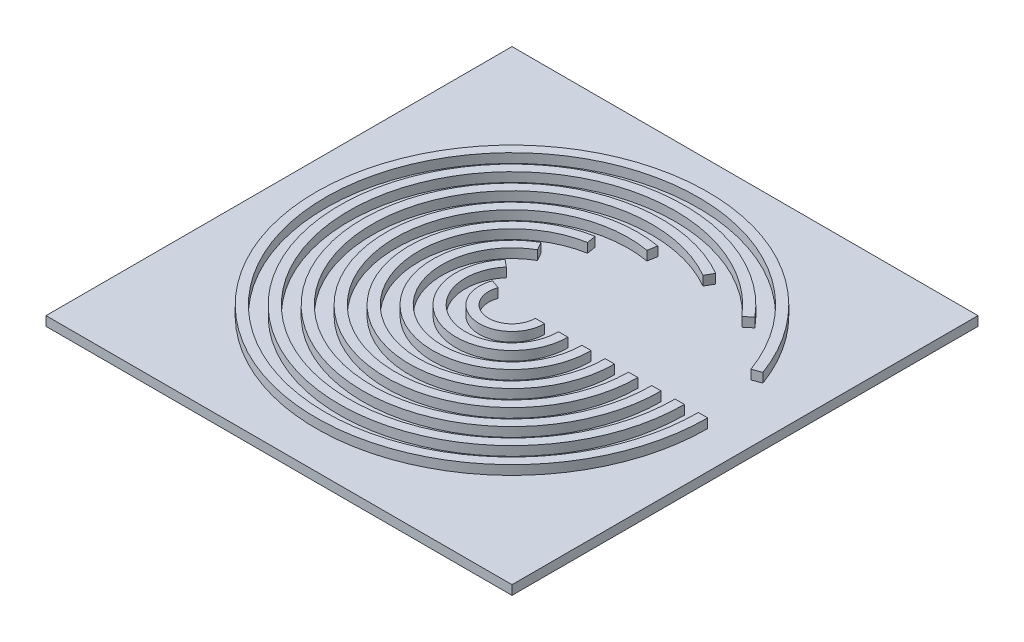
ISO-10303-21;
HEADER;
FILE_DESCRIPTION(('STEP AP214'),'2;1');
FILE_NAME('part.step','',(''),(''),'','','');
FILE_SCHEMA(('AUTOMOTIVE_DESIGN { 1 0 10303 214 1 1 1 1 }'));
ENDSEC;
DATA;
#1=APPLICATION_CONTEXT('core data for automotive mechanical design processes');
#2=APPLICATION_PROTOCOL_DEFINITION('international standard','automotive_design',2000,#1);
#3=PRODUCT_CONTEXT('',#1,'mechanical');
#4=PRODUCT('Part','Part','',(#3));
#5=PRODUCT_RELATED_PRODUCT_CATEGORY('part','',(#4));
#6=PRODUCT_DEFINITION_FORMATION('','',#4);
#7=PRODUCT_DEFINITION_CONTEXT('part definition',#1,'design');
#8=PRODUCT_DEFINITION('design','',#6,#7);
#9=PRODUCT_DEFINITION_SHAPE('','',#8);
#10=(LENGTH_UNIT() NAMED_UNIT(*) SI_UNIT(.MILLI.,.METRE.));
#11=(NAMED_UNIT(*) PLANE_ANGLE_UNIT() SI_UNIT($,.RADIAN.));
#12=(NAMED_UNIT(*) SI_UNIT($,.STERADIAN.) SOLID_ANGLE_UNIT());
#13=UNCERTAINTY_MEASURE_WITH_UNIT(LENGTH_MEASURE(1.E-05),#10,'distance_accuracy_value','');
#14=(GEOMETRIC_REPRESENTATION_CONTEXT(3) GLOBAL_UNCERTAINTY_ASSIGNED_CONTEXT((#13)) GLOBAL_UNIT_ASSIGNED_CONTEXT((#10,
#11,#12)) REPRESENTATION_CONTEXT('',''));
#15=CARTESIAN_POINT('',(0.,0.,0.));
#16=DIRECTION('',(0.,0.,1.));
#17=DIRECTION('',(1.,0.,0.));
#18=AXIS2_PLACEMENT_3D('',#15,#16,#17);
#19=CARTESIAN_POINT('',(0.,10.,0.));
#20=DIRECTION('',(0.,-1.,0.));
#21=DIRECTION('',(0.,0.,-1.));
#22=AXIS2_PLACEMENT_3D('',#19,#20,#21);
#23=PLANE('',#22);
#24=CARTESIAN_POINT('',(250.,10.,-250.));
#25=DIRECTION('',(0.,1.,0.));
#26=DIRECTION('',(1.,0.,0.));
#27=AXIS2_PLACEMENT_3D('',#24,#25,#26);
#28=CIRCLE('',#27,60.);
#29=CARTESIAN_POINT('',(204.037333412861,10.,-288.567256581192));
#30=VERTEX_POINT('',#29);
#31=CARTESIAN_POINT('',(310.,10.,-250.));
#32=VERTEX_POINT('',#31);
#33=EDGE_CURVE('E298',#30,#32,#28,.T.);
#34=ORIENTED_EDGE('',*,*,#33,.F.);
#35=DIRECTION('',(0.766044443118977,0.,0.642787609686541));
#36=VECTOR('',#35,1.);
#37=CARTESIAN_POINT('',(204.037333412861,10.,-288.567256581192));
#38=LINE('',#37,#36);
#39=CARTESIAN_POINT('',(211.697777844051,10.,-282.139380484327));
#40=VERTEX_POINT('',#39);
#41=EDGE_CURVE('E332',#30,#40,#38,.T.);
#42=ORIENTED_EDGE('',*,*,#41,.T.);
#43=CARTESIAN_POINT('',(250.,10.,-250.));
#44=DIRECTION('',(0.,1.,0.));
#45=DIRECTION('',(0.,0.,1.));
#46=AXIS2_PLACEMENT_3D('',#43,#44,#45);
#47=CIRCLE('',#46,50.);
#48=CARTESIAN_POINT('',(300.,10.,-250.));
#49=VERTEX_POINT('',#48);
#50=EDGE_CURVE('E65',#40,#49,#47,.T.);
#51=ORIENTED_EDGE('',*,*,#50,.T.);
#52=DIRECTION('',(1.,0.,0.));
#53=VECTOR('',#52,1.);
#54=CARTESIAN_POINT('',(300.,10.,-250.));
#55=LINE('',#54,#53);
#56=EDGE_CURVE('E348',#49,#32,#55,.T.);
#57=ORIENTED_EDGE('',*,*,#56,.T.);
#58=EDGE_LOOP('',(#34,#42,#51,#57));
#59=FACE_BOUND('',#58,.T.);
#60=CARTESIAN_POINT('',(250.,10.,-250.));
#61=DIRECTION('',(0.,1.,0.));
#62=DIRECTION('',(1.,0.,0.));
#63=AXIS2_PLACEMENT_3D('',#60,#61,#62);
#64=CIRCLE('',#63,110.);
#65=CARTESIAN_POINT('',(230.898700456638,10.,-358.328852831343));
#66=VERTEX_POINT('',#65);
#67=CARTESIAN_POINT('',(360.,10.,-250.));
#68=VERTEX_POINT('',#67);
#69=EDGE_CURVE('E412',#66,#68,#64,.T.);
#70=ORIENTED_EDGE('',*,*,#69,.F.);
#71=DIRECTION('',(0.173648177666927,0.,0.984807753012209));
#72=VECTOR('',#71,1.);
#73=CARTESIAN_POINT('',(230.898700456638,10.,-358.328852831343));
#74=LINE('',#73,#72);
#75=CARTESIAN_POINT('',(232.635182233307,10.,-348.480775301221));
#76=VERTEX_POINT('',#75);
#77=EDGE_CURVE('E417',#66,#76,#74,.T.);
#78=ORIENTED_EDGE('',*,*,#77,.T.);
#79=CARTESIAN_POINT('',(250.,10.,-250.));
#80=DIRECTION('',(0.,1.,0.));
#81=DIRECTION('',(0.,0.,1.));
#82=AXIS2_PLACEMENT_3D('',#79,#80,#81);
#83=CIRCLE('',#82,100.);
#84=CARTESIAN_POINT('',(350.,10.,-250.));
#85=VERTEX_POINT('',#84);
#86=EDGE_CURVE('E437',#76,#85,#83,.T.);
#87=ORIENTED_EDGE('',*,*,#86,.T.);
#88=DIRECTION('',(1.,0.,0.));
#89=VECTOR('',#88,1.);
#90=CARTESIAN_POINT('',(350.,10.,-250.));
#91=LINE('',#90,#89);
#92=EDGE_CURVE('E433',#85,#68,#91,.T.);
#93=ORIENTED_EDGE('',*,*,#92,.T.);
#94=EDGE_LOOP('',(#70,#78,#87,#93));
#95=FACE_BOUND('',#94,.T.);
#96=CARTESIAN_POINT('',(250.,10.,-250.));
#97=DIRECTION('',(0.,1.,0.));
#98=DIRECTION('',(1.,0.,0.));
#99=AXIS2_PLACEMENT_3D('',#96,#97,#98);
#100=CIRCLE('',#99,160.);
#101=CARTESIAN_POINT('',(330.000000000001,10.,-388.56406460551));
#102=VERTEX_POINT('',#101);
#103=CARTESIAN_POINT('',(410.,10.,-250.));
#104=VERTEX_POINT('',#103);
#105=EDGE_CURVE('E500',#102,#104,#100,.T.);
#106=ORIENTED_EDGE('',*,*,#105,.F.);
#107=DIRECTION('',(-0.499999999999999,0.,0.866025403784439));
#108=VECTOR('',#107,1.);
#109=CARTESIAN_POINT('',(330.000000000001,10.,-388.56406460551));
#110=LINE('',#109,#108);
#111=CARTESIAN_POINT('',(325.000000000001,10.,-379.903810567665));
#112=VERTEX_POINT('',#111);
#113=EDGE_CURVE('E505',#102,#112,#110,.T.);
#114=ORIENTED_EDGE('',*,*,#113,.T.);
#115=CARTESIAN_POINT('',(250.,10.,-250.));
#116=DIRECTION('',(0.,1.,0.));
#117=DIRECTION('',(0.,0.,1.));
#118=AXIS2_PLACEMENT_3D('',#115,#116,#117);
#119=CIRCLE('',#118,150.);
#120=CARTESIAN_POINT('',(400.,10.,-250.));
#121=VERTEX_POINT('',#120);
#122=EDGE_CURVE('E525',#112,#121,#119,.T.);
#123=ORIENTED_EDGE('',*,*,#122,.T.);
#124=DIRECTION('',(1.,0.,0.));
#125=VECTOR('',#124,1.);
#126=CARTESIAN_POINT('',(400.,10.,-250.));
#127=LINE('',#126,#125);
#128=EDGE_CURVE('E521',#121,#104,#127,.T.);
#129=ORIENTED_EDGE('',*,*,#128,.T.);
#130=EDGE_LOOP('',(#106,#114,#123,#129));
#131=FACE_BOUND('',#130,.T.);
#132=CARTESIAN_POINT('',(250.,10.,-250.));
#133=DIRECTION('',(0.,1.,0.));
#134=DIRECTION('',(1.,0.,0.));
#135=AXIS2_PLACEMENT_3D('',#132,#133,#134);
#136=CIRCLE('',#135,210.);
#137=CARTESIAN_POINT('',(447.335450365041,10.,-321.824230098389));
#138=VERTEX_POINT('',#137);
#139=CARTESIAN_POINT('',(460.,10.,-250.));
#140=VERTEX_POINT('',#139);
#141=EDGE_CURVE('E588',#138,#140,#136,.T.);
#142=ORIENTED_EDGE('',*,*,#141,.F.);
#143=DIRECTION('',(-0.939692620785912,0.,0.34202014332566));
#144=VECTOR('',#143,1.);
#145=CARTESIAN_POINT('',(447.335450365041,10.,-321.824230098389));
#146=LINE('',#145,#144);
#147=CARTESIAN_POINT('',(437.938524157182,10.,-318.404028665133));
#148=VERTEX_POINT('',#147);
#149=EDGE_CURVE('E593',#138,#148,#146,.T.);
#150=ORIENTED_EDGE('',*,*,#149,.T.);
#151=CARTESIAN_POINT('',(250.,10.,-250.));
#152=DIRECTION('',(0.,1.,0.));
#153=DIRECTION('',(0.,0.,1.));
#154=AXIS2_PLACEMENT_3D('',#151,#152,#153);
#155=CIRCLE('',#154,200.);
#156=CARTESIAN_POINT('',(450.,10.,-250.));
#157=VERTEX_POINT('',#156);
#158=EDGE_CURVE('E613',#148,#157,#155,.T.);
#159=ORIENTED_EDGE('',*,*,#158,.T.);
#160=DIRECTION('',(1.,0.,0.));
#161=VECTOR('',#160,1.);
#162=CARTESIAN_POINT('',(450.,10.,-250.));
#163=LINE('',#162,#161);
#164=EDGE_CURVE('E609',#157,#140,#163,.T.);
#165=ORIENTED_EDGE('',*,*,#164,.T.);
#166=EDGE_LOOP('',(#142,#150,#159,#165));
#167=FACE_BOUND('',#166,.T.);
#168=DIRECTION('',(0.,0.,1.));
#169=VECTOR('',#168,1.);
#170=CARTESIAN_POINT('',(0.,10.,0.));
#171=LINE('',#170,#169);
#172=CARTESIAN_POINT('',(0.,10.,-500.));
#173=VERTEX_POINT('',#172);
#174=CARTESIAN_POINT('',(0.,10.,0.));
#175=VERTEX_POINT('',#174);
#176=EDGE_CURVE('E633',#173,#175,#171,.T.);
#177=ORIENTED_EDGE('',*,*,#176,.T.);
#178=DIRECTION('',(1.,0.,0.));
#179=VECTOR('',#178,1.);
#180=CARTESIAN_POINT('',(0.,10.,0.));
#181=LINE('',#180,#179);
#182=CARTESIAN_POINT('',(500.,10.,0.));
#183=VERTEX_POINT('',#182);
#184=EDGE_CURVE('E637',#175,#183,#181,.T.);
#185=ORIENTED_EDGE('',*,*,#184,.T.);
#186=DIRECTION('',(0.,0.,-1.));
#187=VECTOR('',#186,1.);
#188=CARTESIAN_POINT('',(500.,10.,0.));
#189=LINE('',#188,#187);
#190=CARTESIAN_POINT('',(500.,10.,-500.));
#191=VERTEX_POINT('',#190);
#192=EDGE_CURVE('E641',#183,#191,#189,.T.);
#193=ORIENTED_EDGE('',*,*,#192,.T.);
#194=DIRECTION('',(-1.,0.,0.));
#195=VECTOR('',#194,1.);
#196=CARTESIAN_POINT('',(0.,10.,-500.));
#197=LINE('',#196,#195);
#198=EDGE_CURVE('E644',#191,#173,#197,.T.);
#199=ORIENTED_EDGE('',*,*,#198,.T.);
#200=EDGE_LOOP('',(#177,#185,#193,#199));
#201=FACE_BOUND('',#200,.T.);
#202=CARTESIAN_POINT('',(250.,10.,-250.));
#203=DIRECTION('',(0.,1.,0.));
#204=DIRECTION('',(1.,0.,0.));
#205=AXIS2_PLACEMENT_3D('',#202,#203,#204);
#206=CIRCLE('',#205,185.);
#207=CARTESIAN_POINT('',(391.718221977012,10.,-368.915707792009));
#208=VERTEX_POINT('',#207);
#209=CARTESIAN_POINT('',(435.,10.,-250.));
#210=VERTEX_POINT('',#209);
#211=EDGE_CURVE('E544',#208,#210,#206,.T.);
#212=ORIENTED_EDGE('',*,*,#211,.F.);
#213=DIRECTION('',(-0.766044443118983,0.,0.642787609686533));
#214=VECTOR('',#213,1.);
#215=CARTESIAN_POINT('',(391.718221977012,10.,-368.915707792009));
#216=LINE('',#215,#214);
#217=CARTESIAN_POINT('',(384.057777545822,10.,-362.487831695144));
#218=VERTEX_POINT('',#217);
#219=EDGE_CURVE('E549',#208,#218,#216,.T.);
#220=ORIENTED_EDGE('',*,*,#219,.T.);
#221=CARTESIAN_POINT('',(250.,10.,-250.));
#222=DIRECTION('',(0.,1.,0.));
#223=DIRECTION('',(0.,0.,1.));
#224=AXIS2_PLACEMENT_3D('',#221,#222,#223);
#225=CIRCLE('',#224,175.);
#226=CARTESIAN_POINT('',(425.,10.,-250.));
#227=VERTEX_POINT('',#226);
#228=EDGE_CURVE('E569',#218,#227,#225,.T.);
#229=ORIENTED_EDGE('',*,*,#228,.T.);
#230=DIRECTION('',(1.,0.,0.));
#231=VECTOR('',#230,1.);
#232=CARTESIAN_POINT('',(425.,10.,-250.));
#233=LINE('',#232,#231);
#234=EDGE_CURVE('E565',#227,#210,#233,.T.);
#235=ORIENTED_EDGE('',*,*,#234,.T.);
#236=EDGE_LOOP('',(#212,#220,#229,#235));
#237=FACE_BOUND('',#236,.T.);
#238=CARTESIAN_POINT('',(250.,10.,-250.));
#239=DIRECTION('',(0.,1.,0.));
#240=DIRECTION('',(1.,0.,0.));
#241=AXIS2_PLACEMENT_3D('',#238,#239,#240);
#242=CIRCLE('',#241,135.);
#243=CARTESIAN_POINT('',(273.442503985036,10.,-382.949046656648));
#244=VERTEX_POINT('',#243);
#245=CARTESIAN_POINT('',(385.,10.,-250.));
#246=VERTEX_POINT('',#245);
#247=EDGE_CURVE('E456',#244,#246,#242,.T.);
#248=ORIENTED_EDGE('',*,*,#247,.F.);
#249=DIRECTION('',(-0.173648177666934,0.,0.984807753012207));
#250=VECTOR('',#249,1.);
#251=CARTESIAN_POINT('',(273.442503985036,10.,-382.949046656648));
#252=LINE('',#251,#250);
#253=CARTESIAN_POINT('',(271.706022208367,10.,-373.100969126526));
#254=VERTEX_POINT('',#253);
#255=EDGE_CURVE('E461',#244,#254,#252,.T.);
#256=ORIENTED_EDGE('',*,*,#255,.T.);
#257=CARTESIAN_POINT('',(250.,10.,-250.));
#258=DIRECTION('',(0.,1.,0.));
#259=DIRECTION('',(0.,0.,1.));
#260=AXIS2_PLACEMENT_3D('',#257,#258,#259);
#261=CIRCLE('',#260,125.);
#262=CARTESIAN_POINT('',(375.,10.,-250.));
#263=VERTEX_POINT('',#262);
#264=EDGE_CURVE('E481',#254,#263,#261,.T.);
#265=ORIENTED_EDGE('',*,*,#264,.T.);
#266=DIRECTION('',(1.,0.,0.));
#267=VECTOR('',#266,1.);
#268=CARTESIAN_POINT('',(375.,10.,-250.));
#269=LINE('',#268,#267);
#270=EDGE_CURVE('E477',#263,#246,#269,.T.);
#271=ORIENTED_EDGE('',*,*,#270,.T.);
#272=EDGE_LOOP('',(#248,#256,#265,#271));
#273=FACE_BOUND('',#272,.T.);
#274=CARTESIAN_POINT('',(250.,10.,-250.));
#275=DIRECTION('',(0.,1.,0.));
#276=DIRECTION('',(1.,0.,0.));
#277=AXIS2_PLACEMENT_3D('',#274,#275,#276);
#278=CIRCLE('',#277,85.);
#279=CARTESIAN_POINT('',(207.5,10.,-323.612159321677));
#280=VERTEX_POINT('',#279);
#281=CARTESIAN_POINT('',(335.,10.,-250.));
#282=VERTEX_POINT('',#281);
#283=EDGE_CURVE('E368',#280,#282,#278,.T.);
#284=ORIENTED_EDGE('',*,*,#283,.F.);
#285=DIRECTION('',(0.499999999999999,0.,0.866025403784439));
#286=VECTOR('',#285,1.);
#287=CARTESIAN_POINT('',(207.5,10.,-323.612159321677));
#288=LINE('',#287,#286);
#289=CARTESIAN_POINT('',(212.5,10.,-314.951905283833));
#290=VERTEX_POINT('',#289);
#291=EDGE_CURVE('E373',#280,#290,#288,.T.);
#292=ORIENTED_EDGE('',*,*,#291,.T.);
#293=CARTESIAN_POINT('',(250.,10.,-250.));
#294=DIRECTION('',(0.,1.,0.));
#295=DIRECTION('',(0.,0.,1.));
#296=AXIS2_PLACEMENT_3D('',#293,#294,#295);
#297=CIRCLE('',#296,75.);
#298=CARTESIAN_POINT('',(325.,10.,-250.));
#299=VERTEX_POINT('',#298);
#300=EDGE_CURVE('E393',#290,#299,#297,.T.);
#301=ORIENTED_EDGE('',*,*,#300,.T.);
#302=DIRECTION('',(1.,0.,0.));
#303=VECTOR('',#302,1.);
#304=CARTESIAN_POINT('',(325.,10.,-250.));
#305=LINE('',#304,#303);
#306=EDGE_CURVE('E389',#299,#282,#305,.T.);
#307=ORIENTED_EDGE('',*,*,#306,.T.);
#308=EDGE_LOOP('',(#284,#292,#301,#307));
#309=FACE_BOUND('',#308,.T.);
#310=CARTESIAN_POINT('',(250.,10.,-250.));
#311=DIRECTION('',(0.,1.,0.));
#312=DIRECTION('',(1.,0.,0.));
#313=AXIS2_PLACEMENT_3D('',#310,#311,#312);
#314=CIRCLE('',#313,35.);
#315=CARTESIAN_POINT('',(217.110758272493,10.,-261.970705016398));
#316=VERTEX_POINT('',#315);
#317=CARTESIAN_POINT('',(285.,10.,-250.));
#318=VERTEX_POINT('',#317);
#319=EDGE_CURVE('E293',#316,#318,#314,.T.);
#320=ORIENTED_EDGE('',*,*,#319,.F.);
#321=DIRECTION('',(0.939692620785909,0.,0.342020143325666));
#322=VECTOR('',#321,1.);
#323=CARTESIAN_POINT('',(217.110758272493,10.,-261.970705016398));
#324=LINE('',#323,#322);
#325=CARTESIAN_POINT('',(226.507684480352,10.,-258.550503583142));
#326=VERTEX_POINT('',#325);
#327=EDGE_CURVE('E287',#316,#326,#324,.T.);
#328=ORIENTED_EDGE('',*,*,#327,.T.);
#329=CARTESIAN_POINT('',(250.,10.,-250.));
#330=DIRECTION('',(0.,1.,0.));
#331=DIRECTION('',(0.,0.,1.));
#332=AXIS2_PLACEMENT_3D('',#329,#330,#331);
#333=CIRCLE('',#332,25.0000000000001);
#334=CARTESIAN_POINT('',(275.,10.,-250.));
#335=VERTEX_POINT('',#334);
#336=EDGE_CURVE('E57',#326,#335,#333,.T.);
#337=ORIENTED_EDGE('',*,*,#336,.T.);
#338=DIRECTION('',(1.,0.,0.));
#339=VECTOR('',#338,1.);
#340=CARTESIAN_POINT('',(275.,10.,-250.));
#341=LINE('',#340,#339);
#342=EDGE_CURVE('E313',#335,#318,#341,.T.);
#343=ORIENTED_EDGE('',*,*,#342,.T.);
#344=EDGE_LOOP('',(#320,#328,#337,#343));
#345=FACE_BOUND('',#344,.T.);
#346=ADVANCED_FACE('F41',(#59,#95,#131,#167,#201,#237,#273,#309,#345),#23,.F.);
#347=CARTESIAN_POINT('',(0.,10.,0.));
#348=DIRECTION('',(1.,0.,0.));
#349=DIRECTION('',(0.,0.,-1.));
#350=AXIS2_PLACEMENT_3D('',#347,#348,#349);
#351=PLANE('',#350);
#352=DIRECTION('',(0.,0.,1.));
#353=VECTOR('',#352,1.);
#354=CARTESIAN_POINT('',(0.,0.,0.));
#355=LINE('',#354,#353);
#356=CARTESIAN_POINT('',(0.,0.,-500.));
#357=VERTEX_POINT('',#356);
#358=CARTESIAN_POINT('',(0.,0.,0.));
#359=VERTEX_POINT('',#358);
#360=EDGE_CURVE('E632',#357,#359,#355,.T.);
#361=ORIENTED_EDGE('',*,*,#360,.T.);
#362=DIRECTION('',(0.,-1.,0.));
#363=VECTOR('',#362,1.);
#364=CARTESIAN_POINT('',(0.,10.,0.));
#365=LINE('',#364,#363);
#366=EDGE_CURVE('E11',#175,#359,#365,.T.);
#367=ORIENTED_EDGE('',*,*,#366,.F.);
#368=ORIENTED_EDGE('',*,*,#176,.F.);
#369=DIRECTION('',(0.,-1.,0.));
#370=VECTOR('',#369,1.);
#371=CARTESIAN_POINT('',(0.,10.,-500.));
#372=LINE('',#371,#370);
#373=EDGE_CURVE('E647',#173,#357,#372,.T.);
#374=ORIENTED_EDGE('',*,*,#373,.T.);
#375=EDGE_LOOP('',(#361,#367,#368,#374));
#376=FACE_BOUND('',#375,.T.);
#377=ADVANCED_FACE('F43',(#376),#351,.F.);
#378=CARTESIAN_POINT('',(0.,10.,0.));
#379=DIRECTION('',(0.,0.,-1.));
#380=DIRECTION('',(-1.,0.,0.));
#381=AXIS2_PLACEMENT_3D('',#378,#379,#380);
#382=PLANE('',#381);
#383=DIRECTION('',(1.,0.,0.));
#384=VECTOR('',#383,1.);
#385=CARTESIAN_POINT('',(0.,0.,0.));
#386=LINE('',#385,#384);
#387=CARTESIAN_POINT('',(500.,0.,0.));
#388=VERTEX_POINT('',#387);
#389=EDGE_CURVE('E651',#359,#388,#386,.T.);
#390=ORIENTED_EDGE('',*,*,#389,.T.);
#391=DIRECTION('',(0.,-1.,0.));
#392=VECTOR('',#391,1.);
#393=CARTESIAN_POINT('',(500.,10.,0.));
#394=LINE('',#393,#392);
#395=EDGE_CURVE('E50',#183,#388,#394,.T.);
#396=ORIENTED_EDGE('',*,*,#395,.F.);
#397=ORIENTED_EDGE('',*,*,#184,.F.);
#398=ORIENTED_EDGE('',*,*,#366,.T.);
#399=EDGE_LOOP('',(#390,#396,#397,#398));
#400=FACE_BOUND('',#399,.T.);
#401=ADVANCED_FACE('F687',(#400),#382,.F.);
#402=CARTESIAN_POINT('',(500.,10.,0.));
#403=DIRECTION('',(-1.,0.,0.));
#404=DIRECTION('',(0.,0.,1.));
#405=AXIS2_PLACEMENT_3D('',#402,#403,#404);
#406=PLANE('',#405);
#407=DIRECTION('',(0.,0.,-1.));
#408=VECTOR('',#407,1.);
#409=CARTESIAN_POINT('',(500.,0.,0.));
#410=LINE('',#409,#408);
#411=CARTESIAN_POINT('',(500.,0.,-500.));
#412=VERTEX_POINT('',#411);
#413=EDGE_CURVE('E654',#388,#412,#410,.T.);
#414=ORIENTED_EDGE('',*,*,#413,.T.);
#415=DIRECTION('',(0.,-1.,0.));
#416=VECTOR('',#415,1.);
#417=CARTESIAN_POINT('',(500.,10.,-500.));
#418=LINE('',#417,#416);
#419=EDGE_CURVE('E662',#191,#412,#418,.T.);
#420=ORIENTED_EDGE('',*,*,#419,.F.);
#421=ORIENTED_EDGE('',*,*,#192,.F.);
#422=ORIENTED_EDGE('',*,*,#395,.T.);
#423=EDGE_LOOP('',(#414,#420,#421,#422));
#424=FACE_BOUND('',#423,.T.);
#425=ADVANCED_FACE('F671',(#424),#406,.F.);
#426=CARTESIAN_POINT('',(0.,10.,-500.));
#427=DIRECTION('',(0.,0.,1.));
#428=DIRECTION('',(1.,0.,0.));
#429=AXIS2_PLACEMENT_3D('',#426,#427,#428);
#430=PLANE('',#429);
#431=DIRECTION('',(-1.,0.,0.));
#432=VECTOR('',#431,1.);
#433=CARTESIAN_POINT('',(0.,0.,-500.));
#434=LINE('',#433,#432);
#435=EDGE_CURVE('E638',#412,#357,#434,.T.);
#436=ORIENTED_EDGE('',*,*,#435,.T.);
#437=ORIENTED_EDGE('',*,*,#373,.F.);
#438=ORIENTED_EDGE('',*,*,#198,.F.);
#439=ORIENTED_EDGE('',*,*,#419,.T.);
#440=EDGE_LOOP('',(#436,#437,#438,#439));
#441=FACE_BOUND('',#440,.T.);
#442=ADVANCED_FACE('F680',(#441),#430,.F.);
#443=CARTESIAN_POINT('',(0.,0.,0.));
#444=DIRECTION('',(0.,-1.,0.));
#445=DIRECTION('',(0.,0.,-1.));
#446=AXIS2_PLACEMENT_3D('',#443,#444,#445);
#447=PLANE('',#446);
#448=ORIENTED_EDGE('',*,*,#360,.F.);
#449=ORIENTED_EDGE('',*,*,#435,.F.);
#450=ORIENTED_EDGE('',*,*,#413,.F.);
#451=ORIENTED_EDGE('',*,*,#389,.F.);
#452=EDGE_LOOP('',(#448,#449,#450,#451));
#453=FACE_BOUND('',#452,.T.);
#454=ADVANCED_FACE('F677',(#453),#447,.T.);
#455=CARTESIAN_POINT('',(250.,20.,-250.));
#456=DIRECTION('',(0.,-1.,0.));
#457=DIRECTION('',(0.,0.,-1.));
#458=AXIS2_PLACEMENT_3D('',#455,#456,#457);
#459=CYLINDRICAL_SURFACE('',#458,210.);
#460=ORIENTED_EDGE('',*,*,#141,.T.);
#461=DIRECTION('',(0.,-1.,0.));
#462=VECTOR('',#461,1.);
#463=CARTESIAN_POINT('',(460.,20.,-250.));
#464=LINE('',#463,#462);
#465=CARTESIAN_POINT('',(460.,20.,-250.));
#466=VERTEX_POINT('',#465);
#467=EDGE_CURVE('E629',#466,#140,#464,.T.);
#468=ORIENTED_EDGE('',*,*,#467,.F.);
#469=CARTESIAN_POINT('',(250.,20.,-250.));
#470=DIRECTION('',(0.,1.,0.));
#471=DIRECTION('',(1.,0.,0.));
#472=AXIS2_PLACEMENT_3D('',#469,#470,#471);
#473=CIRCLE('',#472,210.);
#474=CARTESIAN_POINT('',(447.335450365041,20.,-321.824230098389));
#475=VERTEX_POINT('',#474);
#476=EDGE_CURVE('E589',#475,#466,#473,.T.);
#477=ORIENTED_EDGE('',*,*,#476,.F.);
#478=DIRECTION('',(0.,-1.,0.));
#479=VECTOR('',#478,1.);
#480=CARTESIAN_POINT('',(447.335450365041,20.,-321.824230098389));
#481=LINE('',#480,#479);
#482=EDGE_CURVE('E605',#475,#138,#481,.T.);
#483=ORIENTED_EDGE('',*,*,#482,.T.);
#484=EDGE_LOOP('',(#460,#468,#477,#483));
#485=FACE_BOUND('',#484,.T.);
#486=ADVANCED_FACE('F703',(#485),#459,.T.);
#487=CARTESIAN_POINT('',(450.,20.,-250.));
#488=DIRECTION('',(0.,0.,-1.));
#489=DIRECTION('',(-1.,0.,0.));
#490=AXIS2_PLACEMENT_3D('',#487,#488,#489);
#491=PLANE('',#490);
#492=ORIENTED_EDGE('',*,*,#164,.F.);
#493=DIRECTION('',(0.,-1.,0.));
#494=VECTOR('',#493,1.);
#495=CARTESIAN_POINT('',(450.,20.,-250.));
#496=LINE('',#495,#494);
#497=CARTESIAN_POINT('',(450.,20.,-250.));
#498=VERTEX_POINT('',#497);
#499=EDGE_CURVE('E626',#498,#157,#496,.T.);
#500=ORIENTED_EDGE('',*,*,#499,.F.);
#501=DIRECTION('',(1.,0.,0.));
#502=VECTOR('',#501,1.);
#503=CARTESIAN_POINT('',(450.,20.,-250.));
#504=LINE('',#503,#502);
#505=EDGE_CURVE('E592',#498,#466,#504,.T.);
#506=ORIENTED_EDGE('',*,*,#505,.T.);
#507=ORIENTED_EDGE('',*,*,#467,.T.);
#508=EDGE_LOOP('',(#492,#500,#506,#507));
#509=FACE_BOUND('',#508,.T.);
#510=ADVANCED_FACE('F722',(#509),#491,.T.);
#511=CARTESIAN_POINT('',(250.,20.,-250.));
#512=DIRECTION('',(0.,-1.,0.));
#513=DIRECTION('',(0.,0.,-1.));
#514=AXIS2_PLACEMENT_3D('',#511,#512,#513);
#515=CYLINDRICAL_SURFACE('',#514,200.);
#516=ORIENTED_EDGE('',*,*,#158,.F.);
#517=DIRECTION('',(0.,-1.,0.));
#518=VECTOR('',#517,1.);
#519=CARTESIAN_POINT('',(437.938524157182,20.,-318.404028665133));
#520=LINE('',#519,#518);
#521=CARTESIAN_POINT('',(437.938524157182,20.,-318.404028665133));
#522=VERTEX_POINT('',#521);
#523=EDGE_CURVE('E622',#522,#148,#520,.T.);
#524=ORIENTED_EDGE('',*,*,#523,.F.);
#525=CARTESIAN_POINT('',(250.,20.,-250.));
#526=DIRECTION('',(0.,1.,0.));
#527=DIRECTION('',(0.,0.,1.));
#528=AXIS2_PLACEMENT_3D('',#525,#526,#527);
#529=CIRCLE('',#528,200.);
#530=EDGE_CURVE('E597',#522,#498,#529,.T.);
#531=ORIENTED_EDGE('',*,*,#530,.T.);
#532=ORIENTED_EDGE('',*,*,#499,.T.);
#533=EDGE_LOOP('',(#516,#524,#531,#532));
#534=FACE_BOUND('',#533,.T.);
#535=ADVANCED_FACE('F729',(#534),#515,.F.);
#536=CARTESIAN_POINT('',(447.335450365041,20.,-321.824230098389));
#537=DIRECTION('',(0.34202014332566,0.,0.939692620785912));
#538=DIRECTION('',(0.939692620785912,0.,-0.34202014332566));
#539=AXIS2_PLACEMENT_3D('',#536,#537,#538);
#540=PLANE('',#539);
#541=ORIENTED_EDGE('',*,*,#149,.F.);
#542=ORIENTED_EDGE('',*,*,#482,.F.);
#543=DIRECTION('',(-0.939692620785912,0.,0.34202014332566));
#544=VECTOR('',#543,1.);
#545=CARTESIAN_POINT('',(447.335450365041,20.,-321.824230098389));
#546=LINE('',#545,#544);
#547=EDGE_CURVE('E601',#475,#522,#546,.T.);
#548=ORIENTED_EDGE('',*,*,#547,.T.);
#549=ORIENTED_EDGE('',*,*,#523,.T.);
#550=EDGE_LOOP('',(#541,#542,#548,#549));
#551=FACE_BOUND('',#550,.T.);
#552=ADVANCED_FACE('F736',(#551),#540,.T.);
#553=CARTESIAN_POINT('',(250.,20.,-250.));
#554=DIRECTION('',(0.,1.,0.));
#555=DIRECTION('',(1.,0.,0.));
#556=AXIS2_PLACEMENT_3D('',#553,#554,#555);
#557=PLANE('',#556);
#558=ORIENTED_EDGE('',*,*,#476,.T.);
#559=ORIENTED_EDGE('',*,*,#505,.F.);
#560=ORIENTED_EDGE('',*,*,#530,.F.);
#561=ORIENTED_EDGE('',*,*,#547,.F.);
#562=EDGE_LOOP('',(#558,#559,#560,#561));
#563=FACE_BOUND('',#562,.T.);
#564=ADVANCED_FACE('F744',(#563),#557,.T.);
#565=CARTESIAN_POINT('',(250.,20.,-250.));
#566=DIRECTION('',(0.,-1.,0.));
#567=DIRECTION('',(0.,0.,-1.));
#568=AXIS2_PLACEMENT_3D('',#565,#566,#567);
#569=CYLINDRICAL_SURFACE('',#568,185.);
#570=ORIENTED_EDGE('',*,*,#211,.T.);
#571=DIRECTION('',(0.,-1.,0.));
#572=VECTOR('',#571,1.);
#573=CARTESIAN_POINT('',(435.,20.,-250.));
#574=LINE('',#573,#572);
#575=CARTESIAN_POINT('',(435.,20.,-250.));
#576=VERTEX_POINT('',#575);
#577=EDGE_CURVE('E585',#576,#210,#574,.T.);
#578=ORIENTED_EDGE('',*,*,#577,.F.);
#579=CARTESIAN_POINT('',(250.,20.,-250.));
#580=DIRECTION('',(0.,1.,0.));
#581=DIRECTION('',(1.,0.,0.));
#582=AXIS2_PLACEMENT_3D('',#579,#580,#581);
#583=CIRCLE('',#582,185.);
#584=CARTESIAN_POINT('',(391.718221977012,20.,-368.915707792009));
#585=VERTEX_POINT('',#584);
#586=EDGE_CURVE('E545',#585,#576,#583,.T.);
#587=ORIENTED_EDGE('',*,*,#586,.F.);
#588=DIRECTION('',(0.,-1.,0.));
#589=VECTOR('',#588,1.);
#590=CARTESIAN_POINT('',(391.718221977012,20.,-368.915707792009));
#591=LINE('',#590,#589);
#592=EDGE_CURVE('E561',#585,#208,#591,.T.);
#593=ORIENTED_EDGE('',*,*,#592,.T.);
#594=EDGE_LOOP('',(#570,#578,#587,#593));
#595=FACE_BOUND('',#594,.T.);
#596=ADVANCED_FACE('F752',(#595),#569,.T.);
#597=CARTESIAN_POINT('',(425.,20.,-250.));
#598=DIRECTION('',(0.,0.,-1.));
#599=DIRECTION('',(-1.,0.,0.));
#600=AXIS2_PLACEMENT_3D('',#597,#598,#599);
#601=PLANE('',#600);
#602=ORIENTED_EDGE('',*,*,#234,.F.);
#603=DIRECTION('',(0.,-1.,0.));
#604=VECTOR('',#603,1.);
#605=CARTESIAN_POINT('',(425.,20.,-250.));
#606=LINE('',#605,#604);
#607=CARTESIAN_POINT('',(425.,20.,-250.));
#608=VERTEX_POINT('',#607);
#609=EDGE_CURVE('E582',#608,#227,#606,.T.);
#610=ORIENTED_EDGE('',*,*,#609,.F.);
#611=DIRECTION('',(1.,0.,0.));
#612=VECTOR('',#611,1.);
#613=CARTESIAN_POINT('',(425.,20.,-250.));
#614=LINE('',#613,#612);
#615=EDGE_CURVE('E548',#608,#576,#614,.T.);
#616=ORIENTED_EDGE('',*,*,#615,.T.);
#617=ORIENTED_EDGE('',*,*,#577,.T.);
#618=EDGE_LOOP('',(#602,#610,#616,#617));
#619=FACE_BOUND('',#618,.T.);
#620=ADVANCED_FACE('F760',(#619),#601,.T.);
#621=CARTESIAN_POINT('',(250.,20.,-250.));
#622=DIRECTION('',(0.,-1.,0.));
#623=DIRECTION('',(0.,0.,-1.));
#624=AXIS2_PLACEMENT_3D('',#621,#622,#623);
#625=CYLINDRICAL_SURFACE('',#624,175.);
#626=ORIENTED_EDGE('',*,*,#228,.F.);
#627=DIRECTION('',(0.,-1.,0.));
#628=VECTOR('',#627,1.);
#629=CARTESIAN_POINT('',(384.057777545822,20.,-362.487831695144));
#630=LINE('',#629,#628);
#631=CARTESIAN_POINT('',(384.057777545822,20.,-362.487831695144));
#632=VERTEX_POINT('',#631);
#633=EDGE_CURVE('E578',#632,#218,#630,.T.);
#634=ORIENTED_EDGE('',*,*,#633,.F.);
#635=CARTESIAN_POINT('',(250.,20.,-250.));
#636=DIRECTION('',(0.,1.,0.));
#637=DIRECTION('',(0.,0.,1.));
#638=AXIS2_PLACEMENT_3D('',#635,#636,#637);
#639=CIRCLE('',#638,175.);
#640=EDGE_CURVE('E553',#632,#608,#639,.T.);
#641=ORIENTED_EDGE('',*,*,#640,.T.);
#642=ORIENTED_EDGE('',*,*,#609,.T.);
#643=EDGE_LOOP('',(#626,#634,#641,#642));
#644=FACE_BOUND('',#643,.T.);
#645=ADVANCED_FACE('F768',(#644),#625,.F.);
#646=CARTESIAN_POINT('',(391.718221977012,20.,-368.915707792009));
#647=DIRECTION('',(0.642787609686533,0.,0.766044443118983));
#648=DIRECTION('',(0.766044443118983,0.,-0.642787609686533));
#649=AXIS2_PLACEMENT_3D('',#646,#647,#648);
#650=PLANE('',#649);
#651=ORIENTED_EDGE('',*,*,#219,.F.);
#652=ORIENTED_EDGE('',*,*,#592,.F.);
#653=DIRECTION('',(-0.766044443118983,0.,0.642787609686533));
#654=VECTOR('',#653,1.);
#655=CARTESIAN_POINT('',(391.718221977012,20.,-368.915707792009));
#656=LINE('',#655,#654);
#657=EDGE_CURVE('E557',#585,#632,#656,.T.);
#658=ORIENTED_EDGE('',*,*,#657,.T.);
#659=ORIENTED_EDGE('',*,*,#633,.T.);
#660=EDGE_LOOP('',(#651,#652,#658,#659));
#661=FACE_BOUND('',#660,.T.);
#662=ADVANCED_FACE('F776',(#661),#650,.T.);
#663=CARTESIAN_POINT('',(250.,20.,-250.));
#664=DIRECTION('',(0.,1.,0.));
#665=DIRECTION('',(1.,0.,0.));
#666=AXIS2_PLACEMENT_3D('',#663,#664,#665);
#667=PLANE('',#666);
#668=ORIENTED_EDGE('',*,*,#586,.T.);
#669=ORIENTED_EDGE('',*,*,#615,.F.);
#670=ORIENTED_EDGE('',*,*,#640,.F.);
#671=ORIENTED_EDGE('',*,*,#657,.F.);
#672=EDGE_LOOP('',(#668,#669,#670,#671));
#673=FACE_BOUND('',#672,.T.);
#674=ADVANCED_FACE('F784',(#673),#667,.T.);
#675=CARTESIAN_POINT('',(250.,20.,-250.));
#676=DIRECTION('',(0.,-1.,0.));
#677=DIRECTION('',(0.,0.,-1.));
#678=AXIS2_PLACEMENT_3D('',#675,#676,#677);
#679=CYLINDRICAL_SURFACE('',#678,160.);
#680=ORIENTED_EDGE('',*,*,#105,.T.);
#681=DIRECTION('',(0.,-1.,0.));
#682=VECTOR('',#681,1.);
#683=CARTESIAN_POINT('',(410.,20.,-250.));
#684=LINE('',#683,#682);
#685=CARTESIAN_POINT('',(410.,20.,-250.));
#686=VERTEX_POINT('',#685);
#687=EDGE_CURVE('E541',#686,#104,#684,.T.);
#688=ORIENTED_EDGE('',*,*,#687,.F.);
#689=CARTESIAN_POINT('',(250.,20.,-250.));
#690=DIRECTION('',(0.,1.,0.));
#691=DIRECTION('',(1.,0.,0.));
#692=AXIS2_PLACEMENT_3D('',#689,#690,#691);
#693=CIRCLE('',#692,160.);
#694=CARTESIAN_POINT('',(330.000000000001,20.,-388.56406460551));
#695=VERTEX_POINT('',#694);
#696=EDGE_CURVE('E501',#695,#686,#693,.T.);
#697=ORIENTED_EDGE('',*,*,#696,.F.);
#698=DIRECTION('',(0.,-1.,0.));
#699=VECTOR('',#698,1.);
#700=CARTESIAN_POINT('',(330.000000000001,20.,-388.56406460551));
#701=LINE('',#700,#699);
#702=EDGE_CURVE('E517',#695,#102,#701,.T.);
#703=ORIENTED_EDGE('',*,*,#702,.T.);
#704=EDGE_LOOP('',(#680,#688,#697,#703));
#705=FACE_BOUND('',#704,.T.);
#706=ADVANCED_FACE('F792',(#705),#679,.T.);
#707=CARTESIAN_POINT('',(400.,20.,-250.));
#708=DIRECTION('',(0.,0.,-1.));
#709=DIRECTION('',(-1.,0.,0.));
#710=AXIS2_PLACEMENT_3D('',#707,#708,#709);
#711=PLANE('',#710);
#712=ORIENTED_EDGE('',*,*,#128,.F.);
#713=DIRECTION('',(0.,-1.,0.));
#714=VECTOR('',#713,1.);
#715=CARTESIAN_POINT('',(400.,20.,-250.));
#716=LINE('',#715,#714);
#717=CARTESIAN_POINT('',(400.,20.,-250.));
#718=VERTEX_POINT('',#717);
#719=EDGE_CURVE('E538',#718,#121,#716,.T.);
#720=ORIENTED_EDGE('',*,*,#719,.F.);
#721=DIRECTION('',(1.,0.,0.));
#722=VECTOR('',#721,1.);
#723=CARTESIAN_POINT('',(400.,20.,-250.));
#724=LINE('',#723,#722);
#725=EDGE_CURVE('E504',#718,#686,#724,.T.);
#726=ORIENTED_EDGE('',*,*,#725,.T.);
#727=ORIENTED_EDGE('',*,*,#687,.T.);
#728=EDGE_LOOP('',(#712,#720,#726,#727));
#729=FACE_BOUND('',#728,.T.);
#730=ADVANCED_FACE('F800',(#729),#711,.T.);
#731=CARTESIAN_POINT('',(250.,20.,-250.));
#732=DIRECTION('',(0.,-1.,0.));
#733=DIRECTION('',(0.,0.,-1.));
#734=AXIS2_PLACEMENT_3D('',#731,#732,#733);
#735=CYLINDRICAL_SURFACE('',#734,150.);
#736=ORIENTED_EDGE('',*,*,#122,.F.);
#737=DIRECTION('',(0.,-1.,0.));
#738=VECTOR('',#737,1.);
#739=CARTESIAN_POINT('',(325.000000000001,20.,-379.903810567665));
#740=LINE('',#739,#738);
#741=CARTESIAN_POINT('',(325.000000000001,20.,-379.903810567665));
#742=VERTEX_POINT('',#741);
#743=EDGE_CURVE('E534',#742,#112,#740,.T.);
#744=ORIENTED_EDGE('',*,*,#743,.F.);
#745=CARTESIAN_POINT('',(250.,20.,-250.));
#746=DIRECTION('',(0.,1.,0.));
#747=DIRECTION('',(0.,0.,1.));
#748=AXIS2_PLACEMENT_3D('',#745,#746,#747);
#749=CIRCLE('',#748,150.);
#750=EDGE_CURVE('E509',#742,#718,#749,.T.);
#751=ORIENTED_EDGE('',*,*,#750,.T.);
#752=ORIENTED_EDGE('',*,*,#719,.T.);
#753=EDGE_LOOP('',(#736,#744,#751,#752));
#754=FACE_BOUND('',#753,.T.);
#755=ADVANCED_FACE('F808',(#754),#735,.F.);
#756=CARTESIAN_POINT('',(330.000000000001,20.,-388.56406460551));
#757=DIRECTION('',(0.866025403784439,0.,0.499999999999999));
#758=DIRECTION('',(0.499999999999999,0.,-0.866025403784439));
#759=AXIS2_PLACEMENT_3D('',#756,#757,#758);
#760=PLANE('',#759);
#761=ORIENTED_EDGE('',*,*,#113,.F.);
#762=ORIENTED_EDGE('',*,*,#702,.F.);
#763=DIRECTION('',(-0.499999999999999,0.,0.866025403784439));
#764=VECTOR('',#763,1.);
#765=CARTESIAN_POINT('',(330.000000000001,20.,-388.56406460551));
#766=LINE('',#765,#764);
#767=EDGE_CURVE('E513',#695,#742,#766,.T.);
#768=ORIENTED_EDGE('',*,*,#767,.T.);
#769=ORIENTED_EDGE('',*,*,#743,.T.);
#770=EDGE_LOOP('',(#761,#762,#768,#769));
#771=FACE_BOUND('',#770,.T.);
#772=ADVANCED_FACE('F816',(#771),#760,.T.);
#773=CARTESIAN_POINT('',(250.,20.,-250.));
#774=DIRECTION('',(0.,1.,0.));
#775=DIRECTION('',(1.,0.,0.));
#776=AXIS2_PLACEMENT_3D('',#773,#774,#775);
#777=PLANE('',#776);
#778=ORIENTED_EDGE('',*,*,#696,.T.);
#779=ORIENTED_EDGE('',*,*,#725,.F.);
#780=ORIENTED_EDGE('',*,*,#750,.F.);
#781=ORIENTED_EDGE('',*,*,#767,.F.);
#782=EDGE_LOOP('',(#778,#779,#780,#781));
#783=FACE_BOUND('',#782,.T.);
#784=ADVANCED_FACE('F824',(#783),#777,.T.);
#785=CARTESIAN_POINT('',(250.,20.,-250.));
#786=DIRECTION('',(0.,-1.,0.));
#787=DIRECTION('',(0.,0.,-1.));
#788=AXIS2_PLACEMENT_3D('',#785,#786,#787);
#789=CYLINDRICAL_SURFACE('',#788,135.);
#790=ORIENTED_EDGE('',*,*,#247,.T.);
#791=DIRECTION('',(0.,-1.,0.));
#792=VECTOR('',#791,1.);
#793=CARTESIAN_POINT('',(385.,20.,-250.));
#794=LINE('',#793,#792);
#795=CARTESIAN_POINT('',(385.,20.,-250.));
#796=VERTEX_POINT('',#795);
#797=EDGE_CURVE('E497',#796,#246,#794,.T.);
#798=ORIENTED_EDGE('',*,*,#797,.F.);
#799=CARTESIAN_POINT('',(250.,20.,-250.));
#800=DIRECTION('',(0.,1.,0.));
#801=DIRECTION('',(1.,0.,0.));
#802=AXIS2_PLACEMENT_3D('',#799,#800,#801);
#803=CIRCLE('',#802,135.);
#804=CARTESIAN_POINT('',(273.442503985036,20.,-382.949046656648));
#805=VERTEX_POINT('',#804);
#806=EDGE_CURVE('E457',#805,#796,#803,.T.);
#807=ORIENTED_EDGE('',*,*,#806,.F.);
#808=DIRECTION('',(0.,-1.,0.));
#809=VECTOR('',#808,1.);
#810=CARTESIAN_POINT('',(273.442503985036,20.,-382.949046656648));
#811=LINE('',#810,#809);
#812=EDGE_CURVE('E473',#805,#244,#811,.T.);
#813=ORIENTED_EDGE('',*,*,#812,.T.);
#814=EDGE_LOOP('',(#790,#798,#807,#813));
#815=FACE_BOUND('',#814,.T.);
#816=ADVANCED_FACE('F832',(#815),#789,.T.);
#817=CARTESIAN_POINT('',(375.,20.,-250.));
#818=DIRECTION('',(0.,0.,-1.));
#819=DIRECTION('',(-1.,0.,0.));
#820=AXIS2_PLACEMENT_3D('',#817,#818,#819);
#821=PLANE('',#820);
#822=ORIENTED_EDGE('',*,*,#270,.F.);
#823=DIRECTION('',(0.,-1.,0.));
#824=VECTOR('',#823,1.);
#825=CARTESIAN_POINT('',(375.,20.,-250.));
#826=LINE('',#825,#824);
#827=CARTESIAN_POINT('',(375.,20.,-250.));
#828=VERTEX_POINT('',#827);
#829=EDGE_CURVE('E494',#828,#263,#826,.T.);
#830=ORIENTED_EDGE('',*,*,#829,.F.);
#831=DIRECTION('',(1.,0.,0.));
#832=VECTOR('',#831,1.);
#833=CARTESIAN_POINT('',(375.,20.,-250.));
#834=LINE('',#833,#832);
#835=EDGE_CURVE('E460',#828,#796,#834,.T.);
#836=ORIENTED_EDGE('',*,*,#835,.T.);
#837=ORIENTED_EDGE('',*,*,#797,.T.);
#838=EDGE_LOOP('',(#822,#830,#836,#837));
#839=FACE_BOUND('',#838,.T.);
#840=ADVANCED_FACE('F840',(#839),#821,.T.);
#841=CARTESIAN_POINT('',(250.,20.,-250.));
#842=DIRECTION('',(0.,-1.,0.));
#843=DIRECTION('',(0.,0.,-1.));
#844=AXIS2_PLACEMENT_3D('',#841,#842,#843);
#845=CYLINDRICAL_SURFACE('',#844,125.);
#846=ORIENTED_EDGE('',*,*,#264,.F.);
#847=DIRECTION('',(0.,-1.,0.));
#848=VECTOR('',#847,1.);
#849=CARTESIAN_POINT('',(271.706022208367,20.,-373.100969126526));
#850=LINE('',#849,#848);
#851=CARTESIAN_POINT('',(271.706022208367,20.,-373.100969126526));
#852=VERTEX_POINT('',#851);
#853=EDGE_CURVE('E490',#852,#254,#850,.T.);
#854=ORIENTED_EDGE('',*,*,#853,.F.);
#855=CARTESIAN_POINT('',(250.,20.,-250.));
#856=DIRECTION('',(0.,1.,0.));
#857=DIRECTION('',(0.,0.,1.));
#858=AXIS2_PLACEMENT_3D('',#855,#856,#857);
#859=CIRCLE('',#858,125.);
#860=EDGE_CURVE('E465',#852,#828,#859,.T.);
#861=ORIENTED_EDGE('',*,*,#860,.T.);
#862=ORIENTED_EDGE('',*,*,#829,.T.);
#863=EDGE_LOOP('',(#846,#854,#861,#862));
#864=FACE_BOUND('',#863,.T.);
#865=ADVANCED_FACE('F848',(#864),#845,.F.);
#866=CARTESIAN_POINT('',(273.442503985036,20.,-382.949046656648));
#867=DIRECTION('',(0.984807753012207,0.,0.173648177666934));
#868=DIRECTION('',(0.173648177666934,0.,-0.984807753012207));
#869=AXIS2_PLACEMENT_3D('',#866,#867,#868);
#870=PLANE('',#869);
#871=ORIENTED_EDGE('',*,*,#255,.F.);
#872=ORIENTED_EDGE('',*,*,#812,.F.);
#873=DIRECTION('',(-0.173648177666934,0.,0.984807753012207));
#874=VECTOR('',#873,1.);
#875=CARTESIAN_POINT('',(273.442503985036,20.,-382.949046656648));
#876=LINE('',#875,#874);
#877=EDGE_CURVE('E469',#805,#852,#876,.T.);
#878=ORIENTED_EDGE('',*,*,#877,.T.);
#879=ORIENTED_EDGE('',*,*,#853,.T.);
#880=EDGE_LOOP('',(#871,#872,#878,#879));
#881=FACE_BOUND('',#880,.T.);
#882=ADVANCED_FACE('F856',(#881),#870,.T.);
#883=CARTESIAN_POINT('',(250.,20.,-250.));
#884=DIRECTION('',(0.,1.,0.));
#885=DIRECTION('',(1.,0.,0.));
#886=AXIS2_PLACEMENT_3D('',#883,#884,#885);
#887=PLANE('',#886);
#888=ORIENTED_EDGE('',*,*,#806,.T.);
#889=ORIENTED_EDGE('',*,*,#835,.F.);
#890=ORIENTED_EDGE('',*,*,#860,.F.);
#891=ORIENTED_EDGE('',*,*,#877,.F.);
#892=EDGE_LOOP('',(#888,#889,#890,#891));
#893=FACE_BOUND('',#892,.T.);
#894=ADVANCED_FACE('F864',(#893),#887,.T.);
#895=CARTESIAN_POINT('',(250.,20.,-250.));
#896=DIRECTION('',(0.,-1.,0.));
#897=DIRECTION('',(0.,0.,-1.));
#898=AXIS2_PLACEMENT_3D('',#895,#896,#897);
#899=CYLINDRICAL_SURFACE('',#898,110.);
#900=ORIENTED_EDGE('',*,*,#69,.T.);
#901=DIRECTION('',(0.,-1.,0.));
#902=VECTOR('',#901,1.);
#903=CARTESIAN_POINT('',(360.,20.,-250.));
#904=LINE('',#903,#902);
#905=CARTESIAN_POINT('',(360.,20.,-250.));
#906=VERTEX_POINT('',#905);
#907=EDGE_CURVE('E453',#906,#68,#904,.T.);
#908=ORIENTED_EDGE('',*,*,#907,.F.);
#909=CARTESIAN_POINT('',(250.,20.,-250.));
#910=DIRECTION('',(0.,1.,0.));
#911=DIRECTION('',(1.,0.,0.));
#912=AXIS2_PLACEMENT_3D('',#909,#910,#911);
#913=CIRCLE('',#912,110.);
#914=CARTESIAN_POINT('',(230.898700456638,20.,-358.328852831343));
#915=VERTEX_POINT('',#914);
#916=EDGE_CURVE('E413',#915,#906,#913,.T.);
#917=ORIENTED_EDGE('',*,*,#916,.F.);
#918=DIRECTION('',(0.,-1.,0.));
#919=VECTOR('',#918,1.);
#920=CARTESIAN_POINT('',(230.898700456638,20.,-358.328852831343));
#921=LINE('',#920,#919);
#922=EDGE_CURVE('E429',#915,#66,#921,.T.);
#923=ORIENTED_EDGE('',*,*,#922,.T.);
#924=EDGE_LOOP('',(#900,#908,#917,#923));
#925=FACE_BOUND('',#924,.T.);
#926=ADVANCED_FACE('F872',(#925),#899,.T.);
#927=CARTESIAN_POINT('',(350.,20.,-250.));
#928=DIRECTION('',(0.,0.,-1.));
#929=DIRECTION('',(-1.,0.,0.));
#930=AXIS2_PLACEMENT_3D('',#927,#928,#929);
#931=PLANE('',#930);
#932=ORIENTED_EDGE('',*,*,#92,.F.);
#933=DIRECTION('',(0.,-1.,0.));
#934=VECTOR('',#933,1.);
#935=CARTESIAN_POINT('',(350.,20.,-250.));
#936=LINE('',#935,#934);
#937=CARTESIAN_POINT('',(350.,20.,-250.));
#938=VERTEX_POINT('',#937);
#939=EDGE_CURVE('E450',#938,#85,#936,.T.);
#940=ORIENTED_EDGE('',*,*,#939,.F.);
#941=DIRECTION('',(1.,0.,0.));
#942=VECTOR('',#941,1.);
#943=CARTESIAN_POINT('',(350.,20.,-250.));
#944=LINE('',#943,#942);
#945=EDGE_CURVE('E416',#938,#906,#944,.T.);
#946=ORIENTED_EDGE('',*,*,#945,.T.);
#947=ORIENTED_EDGE('',*,*,#907,.T.);
#948=EDGE_LOOP('',(#932,#940,#946,#947));
#949=FACE_BOUND('',#948,.T.);
#950=ADVANCED_FACE('F880',(#949),#931,.T.);
#951=CARTESIAN_POINT('',(250.,20.,-250.));
#952=DIRECTION('',(0.,-1.,0.));
#953=DIRECTION('',(0.,0.,-1.));
#954=AXIS2_PLACEMENT_3D('',#951,#952,#953);
#955=CYLINDRICAL_SURFACE('',#954,100.);
#956=ORIENTED_EDGE('',*,*,#86,.F.);
#957=DIRECTION('',(0.,-1.,0.));
#958=VECTOR('',#957,1.);
#959=CARTESIAN_POINT('',(232.635182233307,20.,-348.480775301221));
#960=LINE('',#959,#958);
#961=CARTESIAN_POINT('',(232.635182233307,20.,-348.480775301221));
#962=VERTEX_POINT('',#961);
#963=EDGE_CURVE('E446',#962,#76,#960,.T.);
#964=ORIENTED_EDGE('',*,*,#963,.F.);
#965=CARTESIAN_POINT('',(250.,20.,-250.));
#966=DIRECTION('',(0.,1.,0.));
#967=DIRECTION('',(0.,0.,1.));
#968=AXIS2_PLACEMENT_3D('',#965,#966,#967);
#969=CIRCLE('',#968,100.);
#970=EDGE_CURVE('E421',#962,#938,#969,.T.);
#971=ORIENTED_EDGE('',*,*,#970,.T.);
#972=ORIENTED_EDGE('',*,*,#939,.T.);
#973=EDGE_LOOP('',(#956,#964,#971,#972));
#974=FACE_BOUND('',#973,.T.);
#975=ADVANCED_FACE('F888',(#974),#955,.F.);
#976=CARTESIAN_POINT('',(230.898700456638,20.,-358.328852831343));
#977=DIRECTION('',(0.984807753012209,0.,-0.173648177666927));
#978=DIRECTION('',(-0.173648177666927,0.,-0.984807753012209));
#979=AXIS2_PLACEMENT_3D('',#976,#977,#978);
#980=PLANE('',#979);
#981=ORIENTED_EDGE('',*,*,#77,.F.);
#982=ORIENTED_EDGE('',*,*,#922,.F.);
#983=DIRECTION('',(0.173648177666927,0.,0.984807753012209));
#984=VECTOR('',#983,1.);
#985=CARTESIAN_POINT('',(230.898700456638,20.,-358.328852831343));
#986=LINE('',#985,#984);
#987=EDGE_CURVE('E425',#915,#962,#986,.T.);
#988=ORIENTED_EDGE('',*,*,#987,.T.);
#989=ORIENTED_EDGE('',*,*,#963,.T.);
#990=EDGE_LOOP('',(#981,#982,#988,#989));
#991=FACE_BOUND('',#990,.T.);
#992=ADVANCED_FACE('F896',(#991),#980,.T.);
#993=CARTESIAN_POINT('',(250.,20.,-250.));
#994=DIRECTION('',(0.,1.,0.));
#995=DIRECTION('',(1.,0.,0.));
#996=AXIS2_PLACEMENT_3D('',#993,#994,#995);
#997=PLANE('',#996);
#998=ORIENTED_EDGE('',*,*,#916,.T.);
#999=ORIENTED_EDGE('',*,*,#945,.F.);
#1000=ORIENTED_EDGE('',*,*,#970,.F.);
#1001=ORIENTED_EDGE('',*,*,#987,.F.);
#1002=EDGE_LOOP('',(#998,#999,#1000,#1001));
#1003=FACE_BOUND('',#1002,.T.);
#1004=ADVANCED_FACE('F904',(#1003),#997,.T.);
#1005=CARTESIAN_POINT('',(250.,20.,-250.));
#1006=DIRECTION('',(0.,-1.,0.));
#1007=DIRECTION('',(0.,0.,-1.));
#1008=AXIS2_PLACEMENT_3D('',#1005,#1006,#1007);
#1009=CYLINDRICAL_SURFACE('',#1008,85.);
#1010=ORIENTED_EDGE('',*,*,#283,.T.);
#1011=DIRECTION('',(0.,-1.,0.));
#1012=VECTOR('',#1011,1.);
#1013=CARTESIAN_POINT('',(335.,20.,-250.));
#1014=LINE('',#1013,#1012);
#1015=CARTESIAN_POINT('',(335.,20.,-250.));
#1016=VERTEX_POINT('',#1015);
#1017=EDGE_CURVE('E409',#1016,#282,#1014,.T.);
#1018=ORIENTED_EDGE('',*,*,#1017,.F.);
#1019=CARTESIAN_POINT('',(250.,20.,-250.));
#1020=DIRECTION('',(0.,1.,0.));
#1021=DIRECTION('',(1.,0.,0.));
#1022=AXIS2_PLACEMENT_3D('',#1019,#1020,#1021);
#1023=CIRCLE('',#1022,85.);
#1024=CARTESIAN_POINT('',(207.5,20.,-323.612159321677));
#1025=VERTEX_POINT('',#1024);
#1026=EDGE_CURVE('E369',#1025,#1016,#1023,.T.);
#1027=ORIENTED_EDGE('',*,*,#1026,.F.);
#1028=DIRECTION('',(0.,-1.,0.));
#1029=VECTOR('',#1028,1.);
#1030=CARTESIAN_POINT('',(207.5,20.,-323.612159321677));
#1031=LINE('',#1030,#1029);
#1032=EDGE_CURVE('E385',#1025,#280,#1031,.T.);
#1033=ORIENTED_EDGE('',*,*,#1032,.T.);
#1034=EDGE_LOOP('',(#1010,#1018,#1027,#1033));
#1035=FACE_BOUND('',#1034,.T.);
#1036=ADVANCED_FACE('F912',(#1035),#1009,.T.);
#1037=CARTESIAN_POINT('',(325.,20.,-250.));
#1038=DIRECTION('',(0.,0.,-1.));
#1039=DIRECTION('',(-1.,0.,0.));
#1040=AXIS2_PLACEMENT_3D('',#1037,#1038,#1039);
#1041=PLANE('',#1040);
#1042=ORIENTED_EDGE('',*,*,#306,.F.);
#1043=DIRECTION('',(0.,-1.,0.));
#1044=VECTOR('',#1043,1.);
#1045=CARTESIAN_POINT('',(325.,20.,-250.));
#1046=LINE('',#1045,#1044);
#1047=CARTESIAN_POINT('',(325.,20.,-250.));
#1048=VERTEX_POINT('',#1047);
#1049=EDGE_CURVE('E406',#1048,#299,#1046,.T.);
#1050=ORIENTED_EDGE('',*,*,#1049,.F.);
#1051=DIRECTION('',(1.,0.,0.));
#1052=VECTOR('',#1051,1.);
#1053=CARTESIAN_POINT('',(325.,20.,-250.));
#1054=LINE('',#1053,#1052);
#1055=EDGE_CURVE('E372',#1048,#1016,#1054,.T.);
#1056=ORIENTED_EDGE('',*,*,#1055,.T.);
#1057=ORIENTED_EDGE('',*,*,#1017,.T.);
#1058=EDGE_LOOP('',(#1042,#1050,#1056,#1057));
#1059=FACE_BOUND('',#1058,.T.);
#1060=ADVANCED_FACE('F920',(#1059),#1041,.T.);
#1061=CARTESIAN_POINT('',(250.,20.,-250.));
#1062=DIRECTION('',(0.,-1.,0.));
#1063=DIRECTION('',(0.,0.,-1.));
#1064=AXIS2_PLACEMENT_3D('',#1061,#1062,#1063);
#1065=CYLINDRICAL_SURFACE('',#1064,75.);
#1066=ORIENTED_EDGE('',*,*,#300,.F.);
#1067=DIRECTION('',(0.,-1.,0.));
#1068=VECTOR('',#1067,1.);
#1069=CARTESIAN_POINT('',(212.5,20.,-314.951905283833));
#1070=LINE('',#1069,#1068);
#1071=CARTESIAN_POINT('',(212.5,20.,-314.951905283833));
#1072=VERTEX_POINT('',#1071);
#1073=EDGE_CURVE('E402',#1072,#290,#1070,.T.);
#1074=ORIENTED_EDGE('',*,*,#1073,.F.);
#1075=CARTESIAN_POINT('',(250.,20.,-250.));
#1076=DIRECTION('',(0.,1.,0.));
#1077=DIRECTION('',(0.,0.,1.));
#1078=AXIS2_PLACEMENT_3D('',#1075,#1076,#1077);
#1079=CIRCLE('',#1078,75.);
#1080=EDGE_CURVE('E377',#1072,#1048,#1079,.T.);
#1081=ORIENTED_EDGE('',*,*,#1080,.T.);
#1082=ORIENTED_EDGE('',*,*,#1049,.T.);
#1083=EDGE_LOOP('',(#1066,#1074,#1081,#1082));
#1084=FACE_BOUND('',#1083,.T.);
#1085=ADVANCED_FACE('F928',(#1084),#1065,.F.);
#1086=CARTESIAN_POINT('',(207.5,20.,-323.612159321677));
#1087=DIRECTION('',(0.866025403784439,0.,-0.499999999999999));
#1088=DIRECTION('',(-0.499999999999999,0.,-0.866025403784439));
#1089=AXIS2_PLACEMENT_3D('',#1086,#1087,#1088);
#1090=PLANE('',#1089);
#1091=ORIENTED_EDGE('',*,*,#291,.F.);
#1092=ORIENTED_EDGE('',*,*,#1032,.F.);
#1093=DIRECTION('',(0.499999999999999,0.,0.866025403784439));
#1094=VECTOR('',#1093,1.);
#1095=CARTESIAN_POINT('',(207.5,20.,-323.612159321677));
#1096=LINE('',#1095,#1094);
#1097=EDGE_CURVE('E381',#1025,#1072,#1096,.T.);
#1098=ORIENTED_EDGE('',*,*,#1097,.T.);
#1099=ORIENTED_EDGE('',*,*,#1073,.T.);
#1100=EDGE_LOOP('',(#1091,#1092,#1098,#1099));
#1101=FACE_BOUND('',#1100,.T.);
#1102=ADVANCED_FACE('F936',(#1101),#1090,.T.);
#1103=CARTESIAN_POINT('',(250.,20.,-250.));
#1104=DIRECTION('',(0.,1.,0.));
#1105=DIRECTION('',(1.,0.,0.));
#1106=AXIS2_PLACEMENT_3D('',#1103,#1104,#1105);
#1107=PLANE('',#1106);
#1108=ORIENTED_EDGE('',*,*,#1026,.T.);
#1109=ORIENTED_EDGE('',*,*,#1055,.F.);
#1110=ORIENTED_EDGE('',*,*,#1080,.F.);
#1111=ORIENTED_EDGE('',*,*,#1097,.F.);
#1112=EDGE_LOOP('',(#1108,#1109,#1110,#1111));
#1113=FACE_BOUND('',#1112,.T.);
#1114=ADVANCED_FACE('F944',(#1113),#1107,.T.);
#1115=CARTESIAN_POINT('',(250.,20.,-250.));
#1116=DIRECTION('',(0.,-1.,0.));
#1117=DIRECTION('',(0.,0.,-1.));
#1118=AXIS2_PLACEMENT_3D('',#1115,#1116,#1117);
#1119=CYLINDRICAL_SURFACE('',#1118,60.);
#1120=ORIENTED_EDGE('',*,*,#33,.T.);
#1121=DIRECTION('',(0.,-1.,0.));
#1122=VECTOR('',#1121,1.);
#1123=CARTESIAN_POINT('',(310.,20.,-250.));
#1124=LINE('',#1123,#1122);
#1125=CARTESIAN_POINT('',(310.,20.,-250.));
#1126=VERTEX_POINT('',#1125);
#1127=EDGE_CURVE('E365',#1126,#32,#1124,.T.);
#1128=ORIENTED_EDGE('',*,*,#1127,.F.);
#1129=CARTESIAN_POINT('',(250.,20.,-250.));
#1130=DIRECTION('',(0.,1.,0.));
#1131=DIRECTION('',(1.,0.,0.));
#1132=AXIS2_PLACEMENT_3D('',#1129,#1130,#1131);
#1133=CIRCLE('',#1132,60.);
#1134=CARTESIAN_POINT('',(204.037333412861,20.,-288.567256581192));
#1135=VERTEX_POINT('',#1134);
#1136=EDGE_CURVE('E328',#1135,#1126,#1133,.T.);
#1137=ORIENTED_EDGE('',*,*,#1136,.F.);
#1138=DIRECTION('',(0.,-1.,0.));
#1139=VECTOR('',#1138,1.);
#1140=CARTESIAN_POINT('',(204.037333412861,20.,-288.567256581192));
#1141=LINE('',#1140,#1139);
#1142=EDGE_CURVE('E344',#1135,#30,#1141,.T.);
#1143=ORIENTED_EDGE('',*,*,#1142,.T.);
#1144=EDGE_LOOP('',(#1120,#1128,#1137,#1143));
#1145=FACE_BOUND('',#1144,.T.);
#1146=ADVANCED_FACE('F952',(#1145),#1119,.T.);
#1147=CARTESIAN_POINT('',(300.,20.,-250.));
#1148=DIRECTION('',(0.,0.,-1.));
#1149=DIRECTION('',(-1.,0.,0.));
#1150=AXIS2_PLACEMENT_3D('',#1147,#1148,#1149);
#1151=PLANE('',#1150);
#1152=ORIENTED_EDGE('',*,*,#56,.F.);
#1153=DIRECTION('',(0.,-1.,0.));
#1154=VECTOR('',#1153,1.);
#1155=CARTESIAN_POINT('',(300.,20.,-250.));
#1156=LINE('',#1155,#1154);
#1157=CARTESIAN_POINT('',(300.,20.,-250.));
#1158=VERTEX_POINT('',#1157);
#1159=EDGE_CURVE('E362',#1158,#49,#1156,.T.);
#1160=ORIENTED_EDGE('',*,*,#1159,.F.);
#1161=DIRECTION('',(1.,0.,0.));
#1162=VECTOR('',#1161,1.);
#1163=CARTESIAN_POINT('',(300.,20.,-250.));
#1164=LINE('',#1163,#1162);
#1165=EDGE_CURVE('E331',#1158,#1126,#1164,.T.);
#1166=ORIENTED_EDGE('',*,*,#1165,.T.);
#1167=ORIENTED_EDGE('',*,*,#1127,.T.);
#1168=EDGE_LOOP('',(#1152,#1160,#1166,#1167));
#1169=FACE_BOUND('',#1168,.T.);
#1170=ADVANCED_FACE('F960',(#1169),#1151,.T.);
#1171=CARTESIAN_POINT('',(250.,20.,-250.));
#1172=DIRECTION('',(0.,-1.,0.));
#1173=DIRECTION('',(0.,0.,-1.));
#1174=AXIS2_PLACEMENT_3D('',#1171,#1172,#1173);
#1175=CYLINDRICAL_SURFACE('',#1174,50.);
#1176=ORIENTED_EDGE('',*,*,#50,.F.);
#1177=DIRECTION('',(0.,-1.,0.));
#1178=VECTOR('',#1177,1.);
#1179=CARTESIAN_POINT('',(211.697777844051,20.,-282.139380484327));
#1180=LINE('',#1179,#1178);
#1181=CARTESIAN_POINT('',(211.697777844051,20.,-282.139380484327));
#1182=VERTEX_POINT('',#1181);
#1183=EDGE_CURVE('E359',#1182,#40,#1180,.T.);
#1184=ORIENTED_EDGE('',*,*,#1183,.F.);
#1185=CARTESIAN_POINT('',(250.,20.,-250.));
#1186=DIRECTION('',(0.,1.,0.));
#1187=DIRECTION('',(0.,0.,1.));
#1188=AXIS2_PLACEMENT_3D('',#1185,#1186,#1187);
#1189=CIRCLE('',#1188,50.);
#1190=EDGE_CURVE('E336',#1182,#1158,#1189,.T.);
#1191=ORIENTED_EDGE('',*,*,#1190,.T.);
#1192=ORIENTED_EDGE('',*,*,#1159,.T.);
#1193=EDGE_LOOP('',(#1176,#1184,#1191,#1192));
#1194=FACE_BOUND('',#1193,.T.);
#1195=ADVANCED_FACE('F968',(#1194),#1175,.F.);
#1196=CARTESIAN_POINT('',(204.037333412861,20.,-288.567256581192));
#1197=DIRECTION('',(0.642787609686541,0.,-0.766044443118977));
#1198=DIRECTION('',(-0.766044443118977,0.,-0.642787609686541));
#1199=AXIS2_PLACEMENT_3D('',#1196,#1197,#1198);
#1200=PLANE('',#1199);
#1201=ORIENTED_EDGE('',*,*,#41,.F.);
#1202=ORIENTED_EDGE('',*,*,#1142,.F.);
#1203=DIRECTION('',(0.766044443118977,0.,0.642787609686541));
#1204=VECTOR('',#1203,1.);
#1205=CARTESIAN_POINT('',(204.037333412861,20.,-288.567256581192));
#1206=LINE('',#1205,#1204);
#1207=EDGE_CURVE('E340',#1135,#1182,#1206,.T.);
#1208=ORIENTED_EDGE('',*,*,#1207,.T.);
#1209=ORIENTED_EDGE('',*,*,#1183,.T.);
#1210=EDGE_LOOP('',(#1201,#1202,#1208,#1209));
#1211=FACE_BOUND('',#1210,.T.);
#1212=ADVANCED_FACE('F976',(#1211),#1200,.T.);
#1213=CARTESIAN_POINT('',(250.,20.,-250.));
#1214=DIRECTION('',(0.,1.,0.));
#1215=DIRECTION('',(1.,0.,0.));
#1216=AXIS2_PLACEMENT_3D('',#1213,#1214,#1215);
#1217=PLANE('',#1216);
#1218=ORIENTED_EDGE('',*,*,#1136,.T.);
#1219=ORIENTED_EDGE('',*,*,#1165,.F.);
#1220=ORIENTED_EDGE('',*,*,#1190,.F.);
#1221=ORIENTED_EDGE('',*,*,#1207,.F.);
#1222=EDGE_LOOP('',(#1218,#1219,#1220,#1221));
#1223=FACE_BOUND('',#1222,.T.);
#1224=ADVANCED_FACE('F983',(#1223),#1217,.T.);
#1225=CARTESIAN_POINT('',(250.,20.,-250.));
#1226=DIRECTION('',(0.,-1.,0.));
#1227=DIRECTION('',(0.,0.,-1.));
#1228=AXIS2_PLACEMENT_3D('',#1225,#1226,#1227);
#1229=CYLINDRICAL_SURFACE('',#1228,35.);
#1230=ORIENTED_EDGE('',*,*,#319,.T.);
#1231=DIRECTION('',(0.,-1.,0.));
#1232=VECTOR('',#1231,1.);
#1233=CARTESIAN_POINT('',(285.,20.,-250.));
#1234=LINE('',#1233,#1232);
#1235=CARTESIAN_POINT('',(285.,20.,-250.));
#1236=VERTEX_POINT('',#1235);
#1237=EDGE_CURVE('E290',#1236,#318,#1234,.T.);
#1238=ORIENTED_EDGE('',*,*,#1237,.F.);
#1239=CARTESIAN_POINT('',(250.,20.,-250.));
#1240=DIRECTION('',(0.,1.,0.));
#1241=DIRECTION('',(1.,0.,0.));
#1242=AXIS2_PLACEMENT_3D('',#1239,#1240,#1241);
#1243=CIRCLE('',#1242,35.);
#1244=CARTESIAN_POINT('',(217.110758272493,20.,-261.970705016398));
#1245=VERTEX_POINT('',#1244);
#1246=EDGE_CURVE('E276',#1245,#1236,#1243,.T.);
#1247=ORIENTED_EDGE('',*,*,#1246,.F.);
#1248=DIRECTION('',(0.,-1.,0.));
#1249=VECTOR('',#1248,1.);
#1250=CARTESIAN_POINT('',(217.110758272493,20.,-261.970705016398));
#1251=LINE('',#1250,#1249);
#1252=EDGE_CURVE('E310',#1245,#316,#1251,.T.);
#1253=ORIENTED_EDGE('',*,*,#1252,.T.);
#1254=EDGE_LOOP('',(#1230,#1238,#1247,#1253));
#1255=FACE_BOUND('',#1254,.T.);
#1256=ADVANCED_FACE('F291',(#1255),#1229,.T.);
#1257=CARTESIAN_POINT('',(275.,20.,-250.));
#1258=DIRECTION('',(0.,0.,-1.));
#1259=DIRECTION('',(-1.,0.,0.));
#1260=AXIS2_PLACEMENT_3D('',#1257,#1258,#1259);
#1261=PLANE('',#1260);
#1262=ORIENTED_EDGE('',*,*,#342,.F.);
#1263=DIRECTION('',(0.,-1.,0.));
#1264=VECTOR('',#1263,1.);
#1265=CARTESIAN_POINT('',(275.,20.,-250.));
#1266=LINE('',#1265,#1264);
#1267=CARTESIAN_POINT('',(275.,20.,-250.));
#1268=VERTEX_POINT('',#1267);
#1269=EDGE_CURVE('E299',#1268,#335,#1266,.T.);
#1270=ORIENTED_EDGE('',*,*,#1269,.F.);
#1271=DIRECTION('',(1.,0.,0.));
#1272=VECTOR('',#1271,1.);
#1273=CARTESIAN_POINT('',(275.,20.,-250.));
#1274=LINE('',#1273,#1272);
#1275=EDGE_CURVE('E281',#1268,#1236,#1274,.T.);
#1276=ORIENTED_EDGE('',*,*,#1275,.T.);
#1277=ORIENTED_EDGE('',*,*,#1237,.T.);
#1278=EDGE_LOOP('',(#1262,#1270,#1276,#1277));
#1279=FACE_BOUND('',#1278,.T.);
#1280=ADVANCED_FACE('F301',(#1279),#1261,.T.);
#1281=CARTESIAN_POINT('',(250.,20.,-250.));
#1282=DIRECTION('',(0.,-1.,0.));
#1283=DIRECTION('',(0.,0.,-1.));
#1284=AXIS2_PLACEMENT_3D('',#1281,#1282,#1283);
#1285=CYLINDRICAL_SURFACE('',#1284,25.0000000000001);
#1286=ORIENTED_EDGE('',*,*,#336,.F.);
#1287=DIRECTION('',(0.,-1.,0.));
#1288=VECTOR('',#1287,1.);
#1289=CARTESIAN_POINT('',(226.507684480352,20.,-258.550503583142));
#1290=LINE('',#1289,#1288);
#1291=CARTESIAN_POINT('',(226.507684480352,20.,-258.550503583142));
#1292=VERTEX_POINT('',#1291);
#1293=EDGE_CURVE('E323',#1292,#326,#1290,.T.);
#1294=ORIENTED_EDGE('',*,*,#1293,.F.);
#1295=CARTESIAN_POINT('',(250.,20.,-250.));
#1296=DIRECTION('',(0.,1.,0.));
#1297=DIRECTION('',(0.,0.,1.));
#1298=AXIS2_PLACEMENT_3D('',#1295,#1296,#1297);
#1299=CIRCLE('',#1298,25.0000000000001);
#1300=EDGE_CURVE('E303',#1292,#1268,#1299,.T.);
#1301=ORIENTED_EDGE('',*,*,#1300,.T.);
#1302=ORIENTED_EDGE('',*,*,#1269,.T.);
#1303=EDGE_LOOP('',(#1286,#1294,#1301,#1302));
#1304=FACE_BOUND('',#1303,.T.);
#1305=ADVANCED_FACE('F1004',(#1304),#1285,.F.);
#1306=CARTESIAN_POINT('',(217.110758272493,20.,-261.970705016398));
#1307=DIRECTION('',(0.342020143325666,0.,-0.939692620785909));
#1308=DIRECTION('',(-0.939692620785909,0.,-0.342020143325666));
#1309=AXIS2_PLACEMENT_3D('',#1306,#1307,#1308);
#1310=PLANE('',#1309);
#1311=ORIENTED_EDGE('',*,*,#327,.F.);
#1312=ORIENTED_EDGE('',*,*,#1252,.F.);
#1313=DIRECTION('',(0.939692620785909,0.,0.342020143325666));
#1314=VECTOR('',#1313,1.);
#1315=CARTESIAN_POINT('',(217.110758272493,20.,-261.970705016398));
#1316=LINE('',#1315,#1314);
#1317=EDGE_CURVE('E284',#1245,#1292,#1316,.T.);
#1318=ORIENTED_EDGE('',*,*,#1317,.T.);
#1319=ORIENTED_EDGE('',*,*,#1293,.T.);
#1320=EDGE_LOOP('',(#1311,#1312,#1318,#1319));
#1321=FACE_BOUND('',#1320,.T.);
#1322=ADVANCED_FACE('F1011',(#1321),#1310,.T.);
#1323=CARTESIAN_POINT('',(250.,20.,-250.));
#1324=DIRECTION('',(0.,1.,0.));
#1325=DIRECTION('',(1.,0.,0.));
#1326=AXIS2_PLACEMENT_3D('',#1323,#1324,#1325);
#1327=PLANE('',#1326);
#1328=ORIENTED_EDGE('',*,*,#1246,.T.);
#1329=ORIENTED_EDGE('',*,*,#1275,.F.);
#1330=ORIENTED_EDGE('',*,*,#1300,.F.);
#1331=ORIENTED_EDGE('',*,*,#1317,.F.);
#1332=EDGE_LOOP('',(#1328,#1329,#1330,#1331));
#1333=FACE_BOUND('',#1332,.T.);
#1334=ADVANCED_FACE('F278',(#1333),#1327,.T.);
#1335=CLOSED_SHELL('',(#346,#377,#401,#425,#442,#454,#486,#510,#535,#552,#564,#596,#620,#645,
#662,#674,#706,#730,#755,#772,#784,#816,#840,#865,#882,#894,#926,#950,#975,#992,#1004,#1036,
#1060,#1085,#1102,#1114,#1146,#1170,#1195,#1212,#1224,#1256,#1280,#1305,#1322,#1334));
#1336=MANIFOLD_SOLID_BREP('B2',#1335);
#1337=ADVANCED_BREP_SHAPE_REPRESENTATION('',(#18,#1336),#14);
#1338=SHAPE_DEFINITION_REPRESENTATION(#9,#1337);
ENDSEC;
END-ISO-10303-21;
